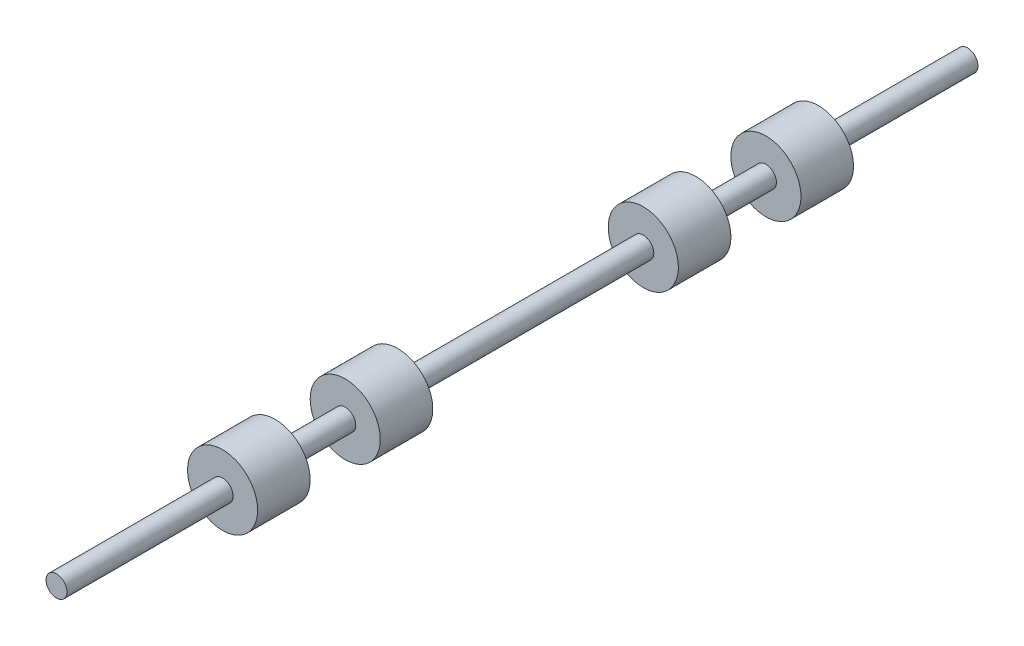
from build123d import *

# Parameters (mm, degrees)
SKETCH_1_R      = 0.3
EXTRUDE_1_DEPTH = 26
SKETCH_2_W      = 1
SKETCH_2_H      = 1.5


with BuildPart() as part:
    # Sketch 1 → Extrude 1 (new body)
    with BuildSketch(Plane.XY):
        Circle(SKETCH_1_R)
    extrude(amount=EXTRUDE_1_DEPTH)

    # Sketch 2 → Revolve 1 (revolve)
    with BuildSketch(Plane(origin=(0, 0, 0), x_dir=(1, 0, 0), z_dir=(0, 1, 0)), mode=Mode.PRIVATE) as revolve_1_sk:
        with Locations((0.5, -5.003)):
            Rectangle(SKETCH_2_W, SKETCH_2_H)
        with Locations((0.5, -8.503)):
            Rectangle(SKETCH_2_W, SKETCH_2_H)
        with Locations((0.5, -17.01)):
            Rectangle(SKETCH_2_W, SKETCH_2_H)
        with Locations((0.5, -20.51)):
            Rectangle(SKETCH_2_W, SKETCH_2_H)
    revolve(revolve_1_sk.sketch.rotate(Axis((0, 0, 0), (0, 0, 1)), 180), axis=Axis((0, 0, 0), (0, 0, 1)))


solid = part.part
